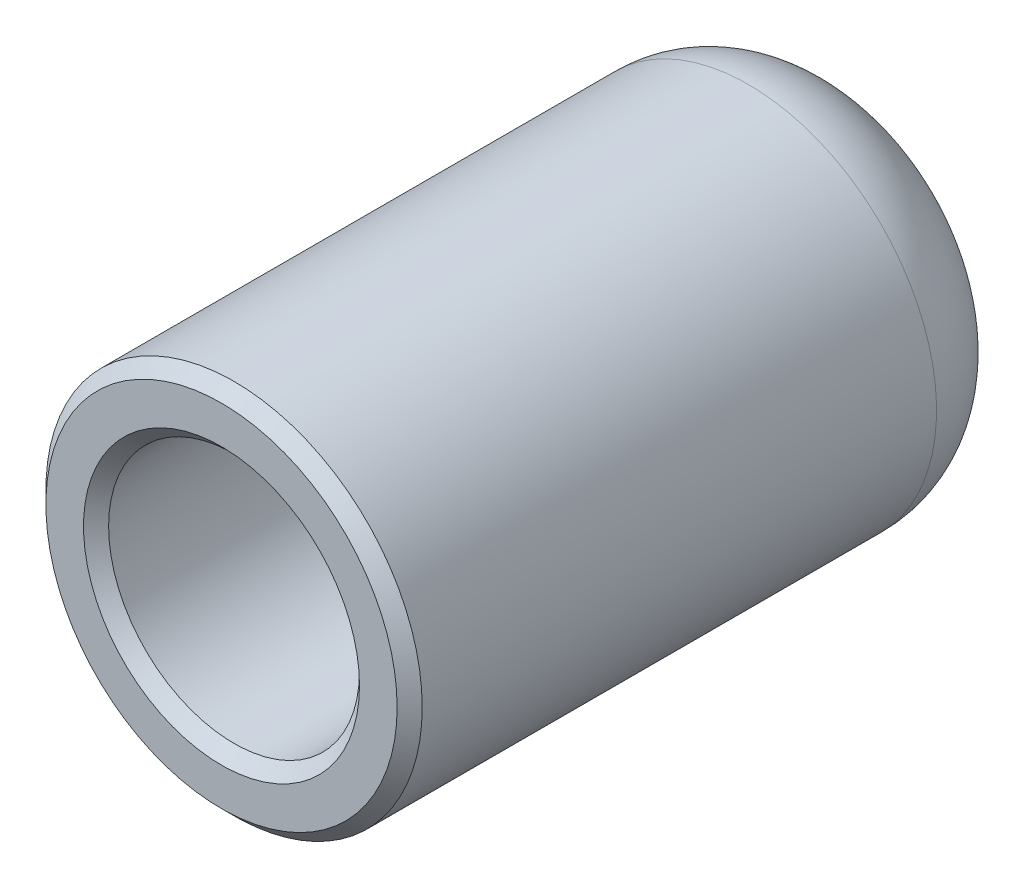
from build123d import *

# Parameters (mm, degrees)
SKETCH1_R               = 7.5
BOSS_EXTRUDE1_DEPTH     = 25
SKETCH4_R               = 2.5
CUT_EXTRUDE2_DEPTH      = 28.156951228
SKETCH5_R               = 5
CUT_EXTRUDE3_DEPTH      = 12
CHAMFER1_SIZE           = 0.5
FILLET2_R               = 4
CUT_EXTRUDE1_DEPTH      = 28.156951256
CUT_EXTRUDE1_DEPTH_BACK = 28.156951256
CUT_EXTRUDE4_DEPTH      = 10


with BuildPart() as part:
    # Sketch1 → Boss-Extrude1 (new body)
    with BuildSketch(Plane.XY):
        Circle(SKETCH1_R)
    extrude(amount=BOSS_EXTRUDE1_DEPTH)

    # Sketch4 → Cut-Extrude2 (cut, through all)
    with BuildSketch(Plane(origin=(0, 0, 0), x_dir=(-1, 0, 0), z_dir=(0, 0, -1))):
        Circle(SKETCH4_R)
    extrude(amount=-CUT_EXTRUDE2_DEPTH, mode=Mode.SUBTRACT)

    # Sketch5 → Cut-Extrude3 (cut)
    with BuildSketch(Plane.XY.offset(25)):
        Circle(SKETCH5_R)
    extrude(amount=-CUT_EXTRUDE3_DEPTH, mode=Mode.SUBTRACT)

    # Chamfer1
    chamfer1_edges = [part.edges().sort_by_distance(p)[0] for p in [
        (-5, 0, 25),
        (-7.5, 0, 25),
    ]]
    chamfer(chamfer1_edges, length=CHAMFER1_SIZE)

    # Fillet2
    fillet2_edges = [part.edges().sort_by_distance(p)[0] for p in [
        (-7.5, 0, 0),
    ]]
    fillet(fillet2_edges, radius=FILLET2_R)

    # Sketch3 → Cut-Extrude1 (cut, two sides: drawn at the far end of the back side and taken through both)
    with BuildSketch(Plane(origin=(0, 0, 0), x_dir=(0, 0, -1), z_dir=(1, 0, 0)).offset(-CUT_EXTRUDE1_DEPTH_BACK)):
        Polygon((-4.3, -7.5), (0, -3.216655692), (0, -7.5), align=None)
    extrude(amount=CUT_EXTRUDE1_DEPTH + CUT_EXTRUDE1_DEPTH_BACK, mode=Mode.SUBTRACT)

    # Sketch2 → Cut-Extrude4 (cut)
    with BuildSketch(Plane(origin=(0, 0, 0), x_dir=(-1, 0, 0), z_dir=(0, 0, -1))):
        Polygon((1.449747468, 3.5), (-1.449747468, 3.5), (-3.5, 1.449747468), (-3.5, -1.449747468), (-1.449747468, -3.5), (1.449747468, -3.5), (3.5, -1.449747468), (3.5, 1.449747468), align=None)
    extrude(amount=-CUT_EXTRUDE4_DEPTH, mode=Mode.SUBTRACT)


solid = part.part
